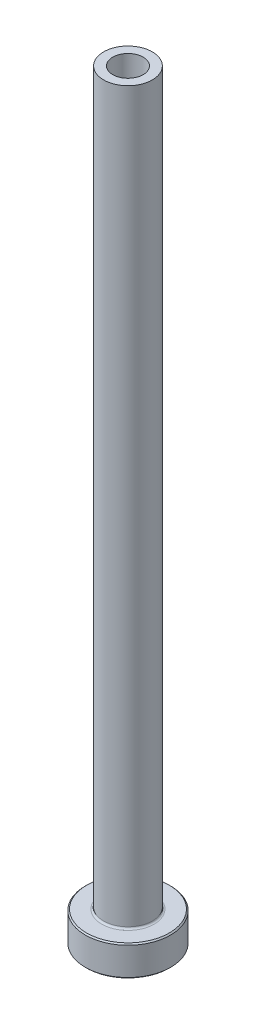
ISO-10303-21;
HEADER;
FILE_DESCRIPTION(('STEP AP214'),'2;1');
FILE_NAME('part.step','',(''),(''),'','','');
FILE_SCHEMA(('AUTOMOTIVE_DESIGN { 1 0 10303 214 1 1 1 1 }'));
ENDSEC;
DATA;
#1=APPLICATION_CONTEXT('core data for automotive mechanical design processes');
#2=APPLICATION_PROTOCOL_DEFINITION('international standard','automotive_design',2000,#1);
#3=PRODUCT_CONTEXT('',#1,'mechanical');
#4=PRODUCT('Part','Part','',(#3));
#5=PRODUCT_RELATED_PRODUCT_CATEGORY('part','',(#4));
#6=PRODUCT_DEFINITION_FORMATION('','',#4);
#7=PRODUCT_DEFINITION_CONTEXT('part definition',#1,'design');
#8=PRODUCT_DEFINITION('design','',#6,#7);
#9=PRODUCT_DEFINITION_SHAPE('','',#8);
#10=(LENGTH_UNIT() NAMED_UNIT(*) SI_UNIT(.MILLI.,.METRE.));
#11=(NAMED_UNIT(*) PLANE_ANGLE_UNIT() SI_UNIT($,.RADIAN.));
#12=(NAMED_UNIT(*) SI_UNIT($,.STERADIAN.) SOLID_ANGLE_UNIT());
#13=UNCERTAINTY_MEASURE_WITH_UNIT(LENGTH_MEASURE(1.E-05),#10,'distance_accuracy_value','');
#14=(GEOMETRIC_REPRESENTATION_CONTEXT(3) GLOBAL_UNCERTAINTY_ASSIGNED_CONTEXT((#13)) GLOBAL_UNIT_ASSIGNED_CONTEXT((#10,
#11,#12)) REPRESENTATION_CONTEXT('',''));
#15=CARTESIAN_POINT('',(0.,0.,0.));
#16=DIRECTION('',(0.,0.,1.));
#17=DIRECTION('',(1.,0.,0.));
#18=AXIS2_PLACEMENT_3D('',#15,#16,#17);
#19=CARTESIAN_POINT('',(0.,92.1876809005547,0.));
#20=DIRECTION('',(0.,1.,0.));
#21=DIRECTION('',(0.,0.,1.));
#22=AXIS2_PLACEMENT_3D('',#19,#20,#21);
#23=CYLINDRICAL_SURFACE('',#22,2.5);
#24=CARTESIAN_POINT('',(0.,125.,0.));
#25=DIRECTION('',(0.,1.,0.));
#26=DIRECTION('',(0.,0.,1.));
#27=AXIS2_PLACEMENT_3D('',#24,#25,#26);
#28=CIRCLE('',#27,2.5);
#29=CARTESIAN_POINT('',(0.,125.,2.5));
#30=VERTEX_POINT('',#29);
#31=EDGE_CURVE('E62',#30,#30,#28,.T.);
#32=ORIENTED_EDGE('',*,*,#31,.T.);
#33=EDGE_LOOP('',(#32));
#34=FACE_BOUND('',#33,.T.);
#35=CARTESIAN_POINT('',(0.,80.,0.));
#36=DIRECTION('',(0.,1.,0.));
#37=DIRECTION('',(0.,0.,1.));
#38=AXIS2_PLACEMENT_3D('',#35,#36,#37);
#39=CIRCLE('',#38,2.5);
#40=CARTESIAN_POINT('',(0.,80.,2.5));
#41=VERTEX_POINT('',#40);
#42=EDGE_CURVE('E71',#41,#41,#39,.T.);
#43=ORIENTED_EDGE('',*,*,#42,.F.);
#44=EDGE_LOOP('',(#43));
#45=FACE_BOUND('',#44,.T.);
#46=ADVANCED_FACE('F30',(#34,#45),#23,.F.);
#47=CARTESIAN_POINT('',(-2.5,125.,0.));
#48=DIRECTION('',(0.,1.,0.));
#49=DIRECTION('',(0.,0.,1.));
#50=AXIS2_PLACEMENT_3D('',#47,#48,#49);
#51=PLANE('',#50);
#52=CARTESIAN_POINT('',(0.,125.,0.));
#53=DIRECTION('',(0.,1.,0.));
#54=DIRECTION('',(0.,0.,1.));
#55=AXIS2_PLACEMENT_3D('',#52,#53,#54);
#56=CIRCLE('',#55,4.);
#57=CARTESIAN_POINT('',(0.,125.,4.));
#58=VERTEX_POINT('',#57);
#59=EDGE_CURVE('E65',#58,#58,#56,.T.);
#60=ORIENTED_EDGE('',*,*,#59,.T.);
#61=EDGE_LOOP('',(#60));
#62=FACE_BOUND('',#61,.T.);
#63=ORIENTED_EDGE('',*,*,#31,.F.);
#64=EDGE_LOOP('',(#63));
#65=FACE_BOUND('',#64,.T.);
#66=ADVANCED_FACE('F79',(#62,#65),#51,.T.);
#67=CARTESIAN_POINT('',(0.,92.1876809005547,0.));
#68=DIRECTION('',(0.,1.,0.));
#69=DIRECTION('',(0.,0.,1.));
#70=AXIS2_PLACEMENT_3D('',#67,#68,#69);
#71=CYLINDRICAL_SURFACE('',#70,4.);
#72=CARTESIAN_POINT('',(0.,5.3,0.));
#73=DIRECTION('',(0.,1.,0.));
#74=DIRECTION('',(0.,0.,1.));
#75=AXIS2_PLACEMENT_3D('',#72,#73,#74);
#76=CIRCLE('',#75,4.);
#77=CARTESIAN_POINT('',(0.,5.3,4.));
#78=VERTEX_POINT('',#77);
#79=EDGE_CURVE('E59',#78,#78,#76,.T.);
#80=ORIENTED_EDGE('',*,*,#79,.T.);
#81=EDGE_LOOP('',(#80));
#82=FACE_BOUND('',#81,.T.);
#83=ORIENTED_EDGE('',*,*,#59,.F.);
#84=EDGE_LOOP('',(#83));
#85=FACE_BOUND('',#84,.T.);
#86=ADVANCED_FACE('F85',(#82,#85),#71,.T.);
#87=CARTESIAN_POINT('',(-3.99999999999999,5.,0.));
#88=DIRECTION('',(0.,1.,0.));
#89=DIRECTION('',(0.,0.,1.));
#90=AXIS2_PLACEMENT_3D('',#87,#88,#89);
#91=PLANE('',#90);
#92=CARTESIAN_POINT('',(0.,5.,0.));
#93=DIRECTION('',(0.,1.,0.));
#94=DIRECTION('',(0.,0.,1.));
#95=AXIS2_PLACEMENT_3D('',#92,#93,#94);
#96=CIRCLE('',#95,6.79999999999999);
#97=CARTESIAN_POINT('',(0.,5.,6.79999999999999));
#98=VERTEX_POINT('',#97);
#99=EDGE_CURVE('E53',#98,#98,#96,.T.);
#100=ORIENTED_EDGE('',*,*,#99,.T.);
#101=EDGE_LOOP('',(#100));
#102=FACE_BOUND('',#101,.T.);
#103=CARTESIAN_POINT('',(0.,5.,0.));
#104=DIRECTION('',(0.,1.,0.));
#105=DIRECTION('',(0.,0.,1.));
#106=AXIS2_PLACEMENT_3D('',#103,#104,#105);
#107=CIRCLE('',#106,4.3);
#108=CARTESIAN_POINT('',(0.,5.,4.3));
#109=VERTEX_POINT('',#108);
#110=EDGE_CURVE('E56',#109,#109,#107,.F.);
#111=ORIENTED_EDGE('',*,*,#110,.T.);
#112=EDGE_LOOP('',(#111));
#113=FACE_BOUND('',#112,.T.);
#114=ADVANCED_FACE('F111',(#102,#113),#91,.T.);
#115=CARTESIAN_POINT('',(0.,92.1876809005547,0.));
#116=DIRECTION('',(0.,1.,0.));
#117=DIRECTION('',(0.,0.,1.));
#118=AXIS2_PLACEMENT_3D('',#115,#116,#117);
#119=CYLINDRICAL_SURFACE('',#118,6.99999999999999);
#120=CARTESIAN_POINT('',(0.,4.8,0.));
#121=DIRECTION('',(0.,1.,0.));
#122=DIRECTION('',(0.,0.,1.));
#123=AXIS2_PLACEMENT_3D('',#120,#121,#122);
#124=CIRCLE('',#123,6.99999999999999);
#125=CARTESIAN_POINT('',(0.,4.8,6.99999999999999));
#126=VERTEX_POINT('',#125);
#127=EDGE_CURVE('E45',#126,#126,#124,.F.);
#128=ORIENTED_EDGE('',*,*,#127,.T.);
#129=EDGE_LOOP('',(#128));
#130=FACE_BOUND('',#129,.T.);
#131=CARTESIAN_POINT('',(0.,0.200000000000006,0.));
#132=DIRECTION('',(0.,-1.,0.));
#133=DIRECTION('',(0.,0.,-1.));
#134=AXIS2_PLACEMENT_3D('',#131,#132,#133);
#135=CIRCLE('',#134,6.99999999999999);
#136=CARTESIAN_POINT('',(0.,0.200000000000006,-6.99999999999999));
#137=VERTEX_POINT('',#136);
#138=EDGE_CURVE('E50',#137,#137,#135,.F.);
#139=ORIENTED_EDGE('',*,*,#138,.T.);
#140=EDGE_LOOP('',(#139));
#141=FACE_BOUND('',#140,.T.);
#142=ADVANCED_FACE('F108',(#130,#141),#119,.T.);
#143=CARTESIAN_POINT('',(-6.99999999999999,0.,0.));
#144=DIRECTION('',(0.,-1.,0.));
#145=DIRECTION('',(0.,0.,-1.));
#146=AXIS2_PLACEMENT_3D('',#143,#144,#145);
#147=PLANE('',#146);
#148=CARTESIAN_POINT('',(0.,0.,0.));
#149=DIRECTION('',(0.,-1.,0.));
#150=DIRECTION('',(0.,0.,-1.));
#151=AXIS2_PLACEMENT_3D('',#148,#149,#150);
#152=CIRCLE('',#151,3.24999999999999);
#153=CARTESIAN_POINT('',(0.,0.,-3.24999999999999));
#154=VERTEX_POINT('',#153);
#155=EDGE_CURVE('E37',#154,#154,#152,.F.);
#156=ORIENTED_EDGE('',*,*,#155,.T.);
#157=EDGE_LOOP('',(#156));
#158=FACE_BOUND('',#157,.T.);
#159=CARTESIAN_POINT('',(0.,0.,0.));
#160=DIRECTION('',(0.,-1.,0.));
#161=DIRECTION('',(0.,0.,-1.));
#162=AXIS2_PLACEMENT_3D('',#159,#160,#161);
#163=CIRCLE('',#162,6.8);
#164=CARTESIAN_POINT('',(0.,0.,-6.8));
#165=VERTEX_POINT('',#164);
#166=EDGE_CURVE('E41',#165,#165,#163,.T.);
#167=ORIENTED_EDGE('',*,*,#166,.T.);
#168=EDGE_LOOP('',(#167));
#169=FACE_BOUND('',#168,.T.);
#170=ADVANCED_FACE('F110',(#158,#169),#147,.T.);
#171=CARTESIAN_POINT('',(0.,92.1876809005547,0.));
#172=DIRECTION('',(0.,1.,0.));
#173=DIRECTION('',(0.,0.,1.));
#174=AXIS2_PLACEMENT_3D('',#171,#172,#173);
#175=CYLINDRICAL_SURFACE('',#174,2.74999999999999);
#176=CARTESIAN_POINT('',(0.,0.5,0.));
#177=DIRECTION('',(0.,-1.,0.));
#178=DIRECTION('',(0.,0.,-1.));
#179=AXIS2_PLACEMENT_3D('',#176,#177,#178);
#180=CIRCLE('',#179,2.74999999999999);
#181=CARTESIAN_POINT('',(0.,0.5,-2.74999999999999));
#182=VERTEX_POINT('',#181);
#183=EDGE_CURVE('E10',#182,#182,#180,.T.);
#184=ORIENTED_EDGE('',*,*,#183,.T.);
#185=EDGE_LOOP('',(#184));
#186=FACE_BOUND('',#185,.T.);
#187=CARTESIAN_POINT('',(0.,68.,0.));
#188=DIRECTION('',(0.,1.,0.));
#189=DIRECTION('',(0.,0.,1.));
#190=AXIS2_PLACEMENT_3D('',#187,#188,#189);
#191=CIRCLE('',#190,2.75);
#192=CARTESIAN_POINT('',(0.,68.,2.75));
#193=VERTEX_POINT('',#192);
#194=EDGE_CURVE('E68',#193,#193,#191,.T.);
#195=ORIENTED_EDGE('',*,*,#194,.T.);
#196=EDGE_LOOP('',(#195));
#197=FACE_BOUND('',#196,.T.);
#198=ADVANCED_FACE('F118',(#186,#197),#175,.F.);
#199=CARTESIAN_POINT('',(0.,68.,0.));
#200=DIRECTION('',(0.,-1.,0.));
#201=DIRECTION('',(0.,0.,-1.));
#202=AXIS2_PLACEMENT_3D('',#199,#200,#201);
#203=CONICAL_SURFACE('',#202,2.75,0.0208303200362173);
#204=ORIENTED_EDGE('',*,*,#42,.T.);
#205=EDGE_LOOP('',(#204));
#206=FACE_BOUND('',#205,.T.);
#207=ORIENTED_EDGE('',*,*,#194,.F.);
#208=EDGE_LOOP('',(#207));
#209=FACE_BOUND('',#208,.T.);
#210=ADVANCED_FACE('F75',(#206,#209),#203,.F.);
#211=CARTESIAN_POINT('',(0.,5.3,0.));
#212=DIRECTION('',(0.,1.,0.));
#213=DIRECTION('',(0.,0.,1.));
#214=AXIS2_PLACEMENT_3D('',#211,#212,#213);
#215=TOROIDAL_SURFACE('',#214,4.3,0.3);
#216=ORIENTED_EDGE('',*,*,#110,.F.);
#217=EDGE_LOOP('',(#216));
#218=FACE_BOUND('',#217,.T.);
#219=ORIENTED_EDGE('',*,*,#79,.F.);
#220=EDGE_LOOP('',(#219));
#221=FACE_BOUND('',#220,.T.);
#222=ADVANCED_FACE('F90',(#218,#221),#215,.F.);
#223=CARTESIAN_POINT('',(0.,5.,0.));
#224=DIRECTION('',(0.,-1.,0.));
#225=DIRECTION('',(0.,0.,-1.));
#226=AXIS2_PLACEMENT_3D('',#223,#224,#225);
#227=CONICAL_SURFACE('',#226,6.79999999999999,0.78539816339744);
#228=ORIENTED_EDGE('',*,*,#127,.F.);
#229=EDGE_LOOP('',(#228));
#230=FACE_BOUND('',#229,.T.);
#231=ORIENTED_EDGE('',*,*,#99,.F.);
#232=EDGE_LOOP('',(#231));
#233=FACE_BOUND('',#232,.T.);
#234=ADVANCED_FACE('F93',(#230,#233),#227,.T.);
#235=CARTESIAN_POINT('',(0.,0.200000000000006,0.));
#236=DIRECTION('',(0.,1.,0.));
#237=DIRECTION('',(0.,0.,1.));
#238=AXIS2_PLACEMENT_3D('',#235,#236,#237);
#239=CONICAL_SURFACE('',#238,6.99999999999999,0.785398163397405);
#240=ORIENTED_EDGE('',*,*,#166,.F.);
#241=EDGE_LOOP('',(#240));
#242=FACE_BOUND('',#241,.T.);
#243=ORIENTED_EDGE('',*,*,#138,.F.);
#244=EDGE_LOOP('',(#243));
#245=FACE_BOUND('',#244,.T.);
#246=ADVANCED_FACE('F96',(#242,#245),#239,.T.);
#247=CARTESIAN_POINT('',(0.,0.,0.));
#248=DIRECTION('',(0.,-1.,0.));
#249=DIRECTION('',(0.,0.,-1.));
#250=AXIS2_PLACEMENT_3D('',#247,#248,#249);
#251=CONICAL_SURFACE('',#250,3.24999999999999,0.785398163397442);
#252=ORIENTED_EDGE('',*,*,#183,.F.);
#253=EDGE_LOOP('',(#252));
#254=FACE_BOUND('',#253,.T.);
#255=ORIENTED_EDGE('',*,*,#155,.F.);
#256=EDGE_LOOP('',(#255));
#257=FACE_BOUND('',#256,.T.);
#258=ADVANCED_FACE('F32',(#254,#257),#251,.F.);
#259=CLOSED_SHELL('',(#46,#66,#86,#114,#142,#170,#198,#210,#222,#234,#246,#258));
#260=MANIFOLD_SOLID_BREP('B2',#259);
#261=ADVANCED_BREP_SHAPE_REPRESENTATION('',(#18,#260),#14);
#262=SHAPE_DEFINITION_REPRESENTATION(#9,#261);
ENDSEC;
END-ISO-10303-21;
